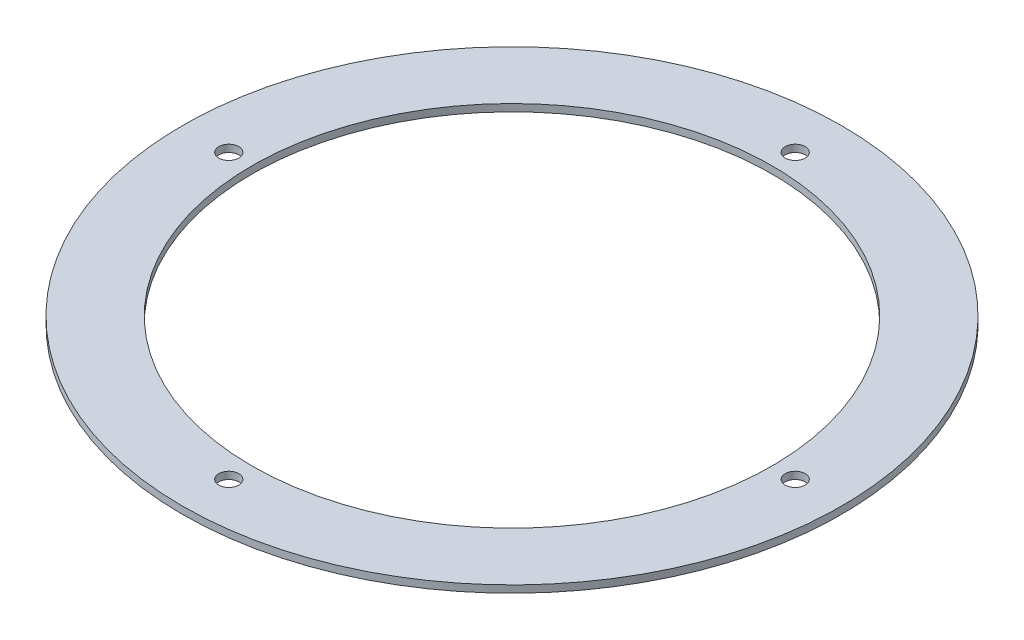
ISO-10303-21;
HEADER;
FILE_DESCRIPTION(('STEP AP214'),'2;1');
FILE_NAME('part.step','',(''),(''),'','','');
FILE_SCHEMA(('AUTOMOTIVE_DESIGN { 1 0 10303 214 1 1 1 1 }'));
ENDSEC;
DATA;
#1=APPLICATION_CONTEXT('core data for automotive mechanical design processes');
#2=APPLICATION_PROTOCOL_DEFINITION('international standard','automotive_design',2000,#1);
#3=PRODUCT_CONTEXT('',#1,'mechanical');
#4=PRODUCT('Part','Part','',(#3));
#5=PRODUCT_RELATED_PRODUCT_CATEGORY('part','',(#4));
#6=PRODUCT_DEFINITION_FORMATION('','',#4);
#7=PRODUCT_DEFINITION_CONTEXT('part definition',#1,'design');
#8=PRODUCT_DEFINITION('design','',#6,#7);
#9=PRODUCT_DEFINITION_SHAPE('','',#8);
#10=(LENGTH_UNIT() NAMED_UNIT(*) SI_UNIT(.MILLI.,.METRE.));
#11=(NAMED_UNIT(*) PLANE_ANGLE_UNIT() SI_UNIT($,.RADIAN.));
#12=(NAMED_UNIT(*) SI_UNIT($,.STERADIAN.) SOLID_ANGLE_UNIT());
#13=UNCERTAINTY_MEASURE_WITH_UNIT(LENGTH_MEASURE(1.E-05),#10,'distance_accuracy_value','');
#14=(GEOMETRIC_REPRESENTATION_CONTEXT(3) GLOBAL_UNCERTAINTY_ASSIGNED_CONTEXT((#13)) GLOBAL_UNIT_ASSIGNED_CONTEXT((#10,
#11,#12)) REPRESENTATION_CONTEXT('',''));
#15=CARTESIAN_POINT('',(0.,0.,0.));
#16=DIRECTION('',(0.,0.,1.));
#17=DIRECTION('',(1.,0.,0.));
#18=AXIS2_PLACEMENT_3D('',#15,#16,#17);
#19=CARTESIAN_POINT('',(0.,1.778,0.));
#20=DIRECTION('',(0.,1.,0.));
#21=DIRECTION('',(0.,0.,1.));
#22=AXIS2_PLACEMENT_3D('',#19,#20,#21);
#23=PLANE('',#22);
#24=CARTESIAN_POINT('',(-69.85,1.778,-7.31639914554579E-13));
#25=DIRECTION('',(0.,1.,0.));
#26=DIRECTION('',(0.,0.,1.));
#27=AXIS2_PLACEMENT_3D('',#24,#25,#26);
#28=CIRCLE('',#27,2.45744999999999);
#29=CARTESIAN_POINT('',(-69.85,1.778,2.45744999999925));
#30=VERTEX_POINT('',#29);
#31=EDGE_CURVE('E70',#30,#30,#28,.T.);
#32=ORIENTED_EDGE('',*,*,#31,.F.);
#33=EDGE_LOOP('',(#32));
#34=FACE_BOUND('',#33,.T.);
#35=CARTESIAN_POINT('',(-4.87759943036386E-13,1.778,69.85));
#36=DIRECTION('',(0.,1.,0.));
#37=DIRECTION('',(0.,0.,1.));
#38=AXIS2_PLACEMENT_3D('',#35,#36,#37);
#39=CIRCLE('',#38,2.45744999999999);
#40=CARTESIAN_POINT('',(-4.87759943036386E-13,1.778,72.30745));
#41=VERTEX_POINT('',#40);
#42=EDGE_CURVE('E64',#41,#41,#39,.T.);
#43=ORIENTED_EDGE('',*,*,#42,.F.);
#44=EDGE_LOOP('',(#43));
#45=FACE_BOUND('',#44,.T.);
#46=CARTESIAN_POINT('',(69.85,1.778,2.43879971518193E-13));
#47=DIRECTION('',(0.,1.,0.));
#48=DIRECTION('',(0.,0.,1.));
#49=AXIS2_PLACEMENT_3D('',#46,#47,#48);
#50=CIRCLE('',#49,2.45744999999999);
#51=CARTESIAN_POINT('',(69.85,1.778,2.45745000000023));
#52=VERTEX_POINT('',#51);
#53=EDGE_CURVE('E58',#52,#52,#50,.T.);
#54=ORIENTED_EDGE('',*,*,#53,.F.);
#55=EDGE_LOOP('',(#54));
#56=FACE_BOUND('',#55,.T.);
#57=CARTESIAN_POINT('',(0.,1.778,-69.85));
#58=DIRECTION('',(0.,1.,0.));
#59=DIRECTION('',(0.,0.,1.));
#60=AXIS2_PLACEMENT_3D('',#57,#58,#59);
#61=CIRCLE('',#60,2.45744999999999);
#62=CARTESIAN_POINT('',(0.,1.778,-67.39255));
#63=VERTEX_POINT('',#62);
#64=EDGE_CURVE('E52',#63,#63,#61,.T.);
#65=ORIENTED_EDGE('',*,*,#64,.F.);
#66=EDGE_LOOP('',(#65));
#67=FACE_BOUND('',#66,.T.);
#68=CARTESIAN_POINT('',(0.,1.778,0.));
#69=DIRECTION('',(0.,1.,0.));
#70=DIRECTION('',(0.,0.,1.));
#71=AXIS2_PLACEMENT_3D('',#68,#69,#70);
#72=CIRCLE('',#71,81.28);
#73=CARTESIAN_POINT('',(0.,1.778,81.28));
#74=VERTEX_POINT('',#73);
#75=EDGE_CURVE('E10',#74,#74,#72,.T.);
#76=ORIENTED_EDGE('',*,*,#75,.T.);
#77=EDGE_LOOP('',(#76));
#78=FACE_BOUND('',#77,.T.);
#79=CARTESIAN_POINT('',(0.,1.778,0.));
#80=DIRECTION('',(0.,1.,0.));
#81=DIRECTION('',(0.,0.,1.));
#82=AXIS2_PLACEMENT_3D('',#79,#80,#81);
#83=CIRCLE('',#82,64.135);
#84=CARTESIAN_POINT('',(0.,1.778,64.135));
#85=VERTEX_POINT('',#84);
#86=EDGE_CURVE('E42',#85,#85,#83,.T.);
#87=ORIENTED_EDGE('',*,*,#86,.F.);
#88=EDGE_LOOP('',(#87));
#89=FACE_BOUND('',#88,.T.);
#90=ADVANCED_FACE('F31',(#34,#45,#56,#67,#78,#89),#23,.T.);
#91=CARTESIAN_POINT('',(0.,0.,0.));
#92=DIRECTION('',(0.,1.,0.));
#93=DIRECTION('',(0.,0.,1.));
#94=AXIS2_PLACEMENT_3D('',#91,#92,#93);
#95=PLANE('',#94);
#96=CARTESIAN_POINT('',(-69.85,0.,-7.31639914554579E-13));
#97=DIRECTION('',(0.,1.,0.));
#98=DIRECTION('',(0.,0.,1.));
#99=AXIS2_PLACEMENT_3D('',#96,#97,#98);
#100=CIRCLE('',#99,2.45744999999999);
#101=CARTESIAN_POINT('',(-69.85,0.,2.45744999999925));
#102=VERTEX_POINT('',#101);
#103=EDGE_CURVE('E67',#102,#102,#100,.T.);
#104=ORIENTED_EDGE('',*,*,#103,.T.);
#105=EDGE_LOOP('',(#104));
#106=FACE_BOUND('',#105,.T.);
#107=CARTESIAN_POINT('',(-4.87759943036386E-13,0.,69.85));
#108=DIRECTION('',(0.,1.,0.));
#109=DIRECTION('',(0.,0.,1.));
#110=AXIS2_PLACEMENT_3D('',#107,#108,#109);
#111=CIRCLE('',#110,2.45744999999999);
#112=CARTESIAN_POINT('',(-4.87759943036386E-13,0.,72.30745));
#113=VERTEX_POINT('',#112);
#114=EDGE_CURVE('E61',#113,#113,#111,.T.);
#115=ORIENTED_EDGE('',*,*,#114,.T.);
#116=EDGE_LOOP('',(#115));
#117=FACE_BOUND('',#116,.T.);
#118=CARTESIAN_POINT('',(69.85,0.,2.43879971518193E-13));
#119=DIRECTION('',(0.,1.,0.));
#120=DIRECTION('',(0.,0.,1.));
#121=AXIS2_PLACEMENT_3D('',#118,#119,#120);
#122=CIRCLE('',#121,2.45744999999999);
#123=CARTESIAN_POINT('',(69.85,0.,2.45745000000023));
#124=VERTEX_POINT('',#123);
#125=EDGE_CURVE('E55',#124,#124,#122,.T.);
#126=ORIENTED_EDGE('',*,*,#125,.T.);
#127=EDGE_LOOP('',(#126));
#128=FACE_BOUND('',#127,.T.);
#129=CARTESIAN_POINT('',(0.,0.,-69.85));
#130=DIRECTION('',(0.,1.,0.));
#131=DIRECTION('',(0.,0.,1.));
#132=AXIS2_PLACEMENT_3D('',#129,#130,#131);
#133=CIRCLE('',#132,2.45744999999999);
#134=CARTESIAN_POINT('',(0.,0.,-67.39255));
#135=VERTEX_POINT('',#134);
#136=EDGE_CURVE('E47',#135,#135,#133,.T.);
#137=ORIENTED_EDGE('',*,*,#136,.T.);
#138=EDGE_LOOP('',(#137));
#139=FACE_BOUND('',#138,.T.);
#140=CARTESIAN_POINT('',(0.,0.,0.));
#141=DIRECTION('',(0.,1.,0.));
#142=DIRECTION('',(0.,0.,1.));
#143=AXIS2_PLACEMENT_3D('',#140,#141,#142);
#144=CIRCLE('',#143,81.28);
#145=CARTESIAN_POINT('',(0.,0.,81.28));
#146=VERTEX_POINT('',#145);
#147=EDGE_CURVE('E35',#146,#146,#144,.T.);
#148=ORIENTED_EDGE('',*,*,#147,.F.);
#149=EDGE_LOOP('',(#148));
#150=FACE_BOUND('',#149,.T.);
#151=CARTESIAN_POINT('',(0.,0.,0.));
#152=DIRECTION('',(0.,1.,0.));
#153=DIRECTION('',(0.,0.,1.));
#154=AXIS2_PLACEMENT_3D('',#151,#152,#153);
#155=CIRCLE('',#154,64.135);
#156=CARTESIAN_POINT('',(0.,0.,64.135));
#157=VERTEX_POINT('',#156);
#158=EDGE_CURVE('E44',#157,#157,#155,.T.);
#159=ORIENTED_EDGE('',*,*,#158,.T.);
#160=EDGE_LOOP('',(#159));
#161=FACE_BOUND('',#160,.T.);
#162=ADVANCED_FACE('F78',(#106,#117,#128,#139,#150,#161),#95,.F.);
#163=CARTESIAN_POINT('',(0.,1.778,0.));
#164=DIRECTION('',(0.,-1.,0.));
#165=DIRECTION('',(0.,0.,-1.));
#166=AXIS2_PLACEMENT_3D('',#163,#164,#165);
#167=CYLINDRICAL_SURFACE('',#166,81.28);
#168=ORIENTED_EDGE('',*,*,#75,.F.);
#169=EDGE_LOOP('',(#168));
#170=FACE_BOUND('',#169,.T.);
#171=ORIENTED_EDGE('',*,*,#147,.T.);
#172=EDGE_LOOP('',(#171));
#173=FACE_BOUND('',#172,.T.);
#174=ADVANCED_FACE('F33',(#170,#173),#167,.T.);
#175=CARTESIAN_POINT('',(0.,1.778,0.));
#176=DIRECTION('',(0.,-1.,0.));
#177=DIRECTION('',(0.,0.,-1.));
#178=AXIS2_PLACEMENT_3D('',#175,#176,#177);
#179=CYLINDRICAL_SURFACE('',#178,64.135);
#180=ORIENTED_EDGE('',*,*,#86,.T.);
#181=EDGE_LOOP('',(#180));
#182=FACE_BOUND('',#181,.T.);
#183=ORIENTED_EDGE('',*,*,#158,.F.);
#184=EDGE_LOOP('',(#183));
#185=FACE_BOUND('',#184,.T.);
#186=ADVANCED_FACE('F88',(#182,#185),#179,.F.);
#187=CARTESIAN_POINT('',(0.,1.778,-69.85));
#188=DIRECTION('',(0.,1.,0.));
#189=DIRECTION('',(0.,0.,1.));
#190=AXIS2_PLACEMENT_3D('',#187,#188,#189);
#191=CYLINDRICAL_SURFACE('',#190,2.45744999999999);
#192=ORIENTED_EDGE('',*,*,#136,.F.);
#193=EDGE_LOOP('',(#192));
#194=FACE_BOUND('',#193,.T.);
#195=ORIENTED_EDGE('',*,*,#64,.T.);
#196=EDGE_LOOP('',(#195));
#197=FACE_BOUND('',#196,.T.);
#198=ADVANCED_FACE('F91',(#194,#197),#191,.F.);
#199=CARTESIAN_POINT('',(69.85,1.778,2.43879971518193E-13));
#200=DIRECTION('',(0.,1.,0.));
#201=DIRECTION('',(0.,0.,1.));
#202=AXIS2_PLACEMENT_3D('',#199,#200,#201);
#203=CYLINDRICAL_SURFACE('',#202,2.45744999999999);
#204=ORIENTED_EDGE('',*,*,#125,.F.);
#205=EDGE_LOOP('',(#204));
#206=FACE_BOUND('',#205,.T.);
#207=ORIENTED_EDGE('',*,*,#53,.T.);
#208=EDGE_LOOP('',(#207));
#209=FACE_BOUND('',#208,.T.);
#210=ADVANCED_FACE('F105',(#206,#209),#203,.F.);
#211=CARTESIAN_POINT('',(-4.87759943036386E-13,1.778,69.85));
#212=DIRECTION('',(0.,1.,0.));
#213=DIRECTION('',(0.,0.,1.));
#214=AXIS2_PLACEMENT_3D('',#211,#212,#213);
#215=CYLINDRICAL_SURFACE('',#214,2.45744999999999);
#216=ORIENTED_EDGE('',*,*,#114,.F.);
#217=EDGE_LOOP('',(#216));
#218=FACE_BOUND('',#217,.T.);
#219=ORIENTED_EDGE('',*,*,#42,.T.);
#220=EDGE_LOOP('',(#219));
#221=FACE_BOUND('',#220,.T.);
#222=ADVANCED_FACE('F109',(#218,#221),#215,.F.);
#223=CARTESIAN_POINT('',(-69.85,1.778,-7.31639914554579E-13));
#224=DIRECTION('',(0.,1.,0.));
#225=DIRECTION('',(0.,0.,1.));
#226=AXIS2_PLACEMENT_3D('',#223,#224,#225);
#227=CYLINDRICAL_SURFACE('',#226,2.45744999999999);
#228=ORIENTED_EDGE('',*,*,#103,.F.);
#229=EDGE_LOOP('',(#228));
#230=FACE_BOUND('',#229,.T.);
#231=ORIENTED_EDGE('',*,*,#31,.T.);
#232=EDGE_LOOP('',(#231));
#233=FACE_BOUND('',#232,.T.);
#234=ADVANCED_FACE('F74',(#230,#233),#227,.F.);
#235=CLOSED_SHELL('',(#90,#162,#174,#186,#198,#210,#222,#234));
#236=MANIFOLD_SOLID_BREP('B2',#235);
#237=ADVANCED_BREP_SHAPE_REPRESENTATION('',(#18,#236),#14);
#238=SHAPE_DEFINITION_REPRESENTATION(#9,#237);
ENDSEC;
END-ISO-10303-21;
